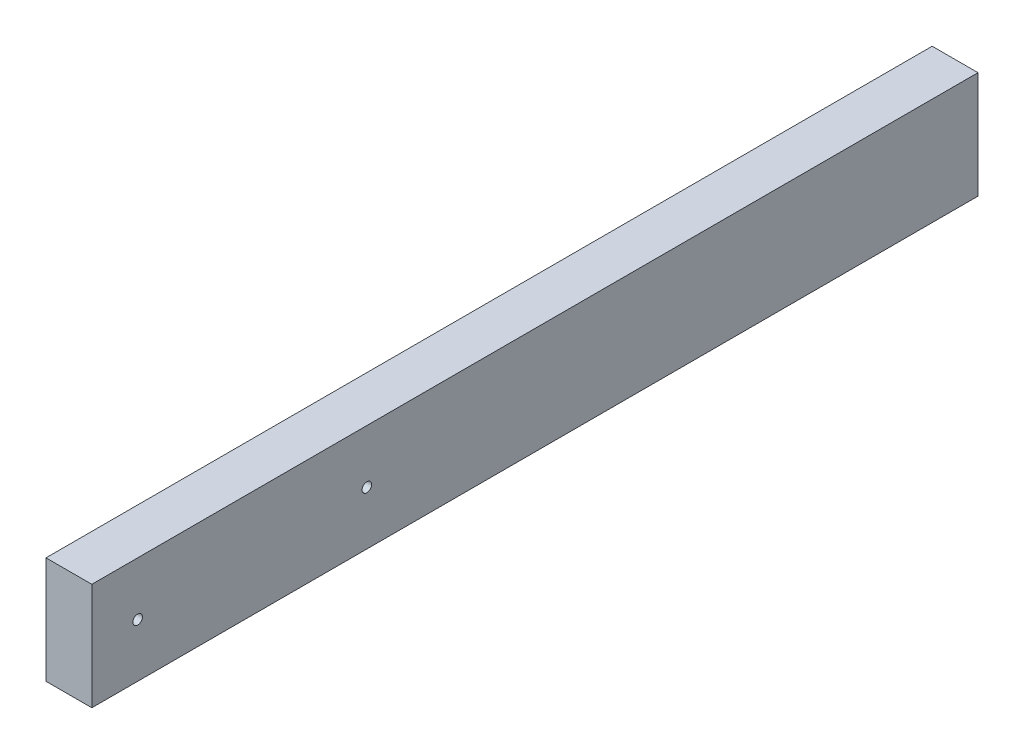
from build123d import *

# Parameters (mm, degrees)
SKETCH1_W                      = 38.1
SKETCH1_H                      = 88.9
BOSS_EXTRUDE1_DEPTH            = 736.6
F_5_16_0_3125_DIAMETER_HOLE1_D = 7.9375


with BuildPart() as part:
    # Sketch1 → Boss-Extrude1 (new body)
    with BuildSketch(Plane.XY):
        Rectangle(SKETCH1_W, SKETCH1_H)
    extrude(amount=BOSS_EXTRUDE1_DEPTH)

    # 5_16 _0.3125_ Diameter Hole1 (through all)
    with Locations(Plane(origin=(19.05, 0, 0), x_dir=(0, 0, -1), z_dir=(1, 0, 0))):
        with Locations((-698.5, 0), (-508, 0)):
            Hole(F_5_16_0_3125_DIAMETER_HOLE1_D / 2)


solid = part.part
